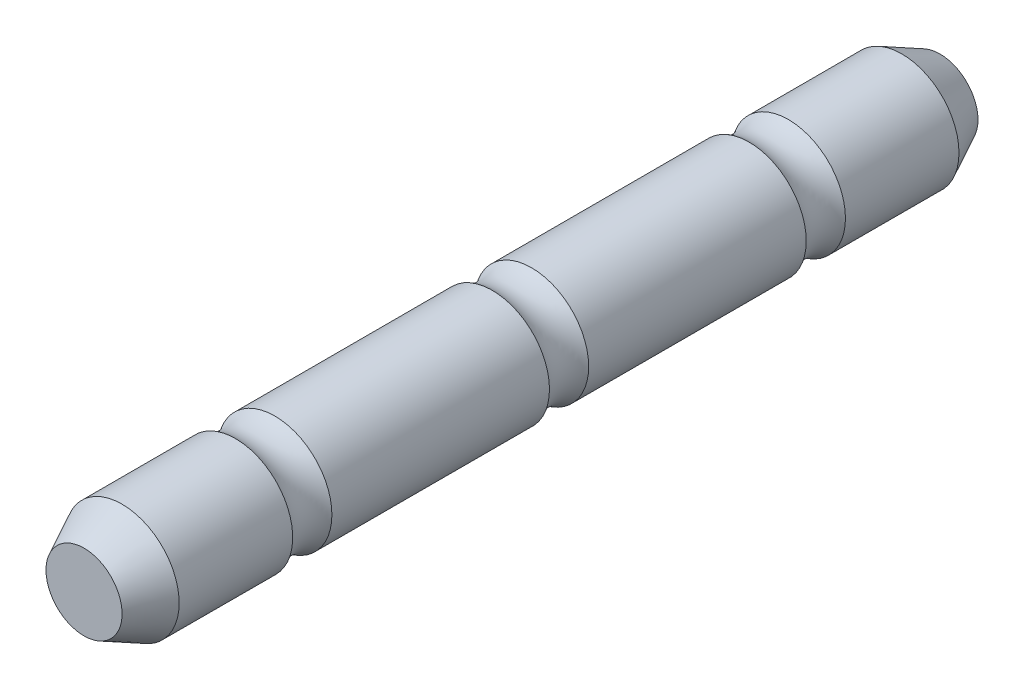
ISO-10303-21;
HEADER;
FILE_DESCRIPTION(('STEP AP214'),'2;1');
FILE_NAME('part.step','',(''),(''),'','','');
FILE_SCHEMA(('AUTOMOTIVE_DESIGN { 1 0 10303 214 1 1 1 1 }'));
ENDSEC;
DATA;
#1=APPLICATION_CONTEXT('core data for automotive mechanical design processes');
#2=APPLICATION_PROTOCOL_DEFINITION('international standard','automotive_design',2000,#1);
#3=PRODUCT_CONTEXT('',#1,'mechanical');
#4=PRODUCT('Part','Part','',(#3));
#5=PRODUCT_RELATED_PRODUCT_CATEGORY('part','',(#4));
#6=PRODUCT_DEFINITION_FORMATION('','',#4);
#7=PRODUCT_DEFINITION_CONTEXT('part definition',#1,'design');
#8=PRODUCT_DEFINITION('design','',#6,#7);
#9=PRODUCT_DEFINITION_SHAPE('','',#8);
#10=(LENGTH_UNIT() NAMED_UNIT(*) SI_UNIT(.MILLI.,.METRE.));
#11=(NAMED_UNIT(*) PLANE_ANGLE_UNIT() SI_UNIT($,.RADIAN.));
#12=(NAMED_UNIT(*) SI_UNIT($,.STERADIAN.) SOLID_ANGLE_UNIT());
#13=UNCERTAINTY_MEASURE_WITH_UNIT(LENGTH_MEASURE(1.E-05),#10,'distance_accuracy_value','');
#14=(GEOMETRIC_REPRESENTATION_CONTEXT(3) GLOBAL_UNCERTAINTY_ASSIGNED_CONTEXT((#13)) GLOBAL_UNIT_ASSIGNED_CONTEXT((#10,
#11,#12)) REPRESENTATION_CONTEXT('',''));
#15=CARTESIAN_POINT('',(0.,0.,0.));
#16=DIRECTION('',(0.,0.,1.));
#17=DIRECTION('',(1.,0.,0.));
#18=AXIS2_PLACEMENT_3D('',#15,#16,#17);
#19=CARTESIAN_POINT('',(0.,0.,-22.5));
#20=DIRECTION('',(0.,0.,-1.));
#21=DIRECTION('',(-1.,0.,0.));
#22=AXIS2_PLACEMENT_3D('',#19,#20,#21);
#23=PLANE('',#22);
#24=CARTESIAN_POINT('',(0.,0.,-22.5000000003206));
#25=DIRECTION('',(0.,0.,1.));
#26=DIRECTION('',(1.,0.,0.));
#27=AXIS2_PLACEMENT_3D('',#24,#25,#26);
#28=CIRCLE('',#27,2.00000000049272);
#29=CARTESIAN_POINT('',(2.00000000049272,0.,-22.5000000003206));
#30=VERTEX_POINT('',#29);
#31=EDGE_CURVE('E16',#30,#30,#28,.T.);
#32=ORIENTED_EDGE('',*,*,#31,.F.);
#33=EDGE_LOOP('',(#32));
#34=FACE_BOUND('',#33,.T.);
#35=ADVANCED_FACE('F13',(#34),#23,.T.);
#36=CARTESIAN_POINT('',(0.,0.,-20.4999999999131));
#37=DIRECTION('',(0.,0.,1.));
#38=DIRECTION('',(1.,0.,0.));
#39=AXIS2_PLACEMENT_3D('',#36,#37,#38);
#40=CONICAL_SURFACE('',#39,2.99999999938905,0.463647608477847);
#41=CARTESIAN_POINT('',(0.,0.,-20.5));
#42=DIRECTION('',(0.,0.,1.));
#43=DIRECTION('',(1.,0.,0.));
#44=AXIS2_PLACEMENT_3D('',#41,#42,#43);
#45=CIRCLE('',#44,3.);
#46=CARTESIAN_POINT('',(3.,0.,-20.5));
#47=VERTEX_POINT('',#46);
#48=EDGE_CURVE('E166',#47,#47,#45,.T.);
#49=ORIENTED_EDGE('',*,*,#48,.F.);
#50=EDGE_LOOP('',(#49));
#51=FACE_BOUND('',#50,.T.);
#52=ORIENTED_EDGE('',*,*,#31,.T.);
#53=EDGE_LOOP('',(#52));
#54=FACE_BOUND('',#53,.T.);
#55=ADVANCED_FACE('F93',(#51,#54),#40,.T.);
#56=CARTESIAN_POINT('',(0.,0.,22.5));
#57=DIRECTION('',(0.,0.,-1.));
#58=DIRECTION('',(-1.,0.,0.));
#59=AXIS2_PLACEMENT_3D('',#56,#57,#58);
#60=PLANE('',#59);
#61=CARTESIAN_POINT('',(0.,0.,22.5000000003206));
#62=DIRECTION('',(0.,0.,-1.));
#63=DIRECTION('',(-1.,0.,0.));
#64=AXIS2_PLACEMENT_3D('',#61,#62,#63);
#65=CIRCLE('',#64,2.00000000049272);
#66=CARTESIAN_POINT('',(-2.00000000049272,0.,22.5000000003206));
#67=VERTEX_POINT('',#66);
#68=EDGE_CURVE('E165',#67,#67,#65,.T.);
#69=ORIENTED_EDGE('',*,*,#68,.F.);
#70=EDGE_LOOP('',(#69));
#71=FACE_BOUND('',#70,.T.);
#72=ADVANCED_FACE('F90',(#71),#60,.F.);
#73=CARTESIAN_POINT('',(0.,0.,0.));
#74=DIRECTION('',(0.,0.,1.));
#75=DIRECTION('',(1.,0.,0.));
#76=AXIS2_PLACEMENT_3D('',#73,#74,#75);
#77=CYLINDRICAL_SURFACE('',#76,3.);
#78=CARTESIAN_POINT('',(0.,0.,-14.530727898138));
#79=DIRECTION('',(0.,0.,-1.));
#80=DIRECTION('',(-1.,0.,0.));
#81=AXIS2_PLACEMENT_3D('',#78,#79,#80);
#82=CIRCLE('',#81,3.);
#83=CARTESIAN_POINT('',(-3.,0.,-14.530727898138));
#84=VERTEX_POINT('',#83);
#85=EDGE_CURVE('E71',#84,#84,#82,.T.);
#86=ORIENTED_EDGE('',*,*,#85,.T.);
#87=EDGE_LOOP('',(#86));
#88=FACE_BOUND('',#87,.T.);
#89=ORIENTED_EDGE('',*,*,#48,.T.);
#90=EDGE_LOOP('',(#89));
#91=FACE_BOUND('',#90,.T.);
#92=ADVANCED_FACE('F86',(#88,#91),#77,.T.);
#93=CARTESIAN_POINT('',(0.,0.,20.4999999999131));
#94=DIRECTION('',(0.,0.,-1.));
#95=DIRECTION('',(-1.,0.,0.));
#96=AXIS2_PLACEMENT_3D('',#93,#94,#95);
#97=CONICAL_SURFACE('',#96,2.99999999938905,0.463647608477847);
#98=CARTESIAN_POINT('',(0.,0.,20.5));
#99=DIRECTION('',(0.,0.,1.));
#100=DIRECTION('',(1.,0.,0.));
#101=AXIS2_PLACEMENT_3D('',#98,#99,#100);
#102=CIRCLE('',#101,3.);
#103=CARTESIAN_POINT('',(3.,0.,20.5));
#104=VERTEX_POINT('',#103);
#105=EDGE_CURVE('E66',#104,#104,#102,.F.);
#106=ORIENTED_EDGE('',*,*,#105,.F.);
#107=EDGE_LOOP('',(#106));
#108=FACE_BOUND('',#107,.T.);
#109=ORIENTED_EDGE('',*,*,#68,.T.);
#110=EDGE_LOOP('',(#109));
#111=FACE_BOUND('',#110,.T.);
#112=ADVANCED_FACE('F82',(#108,#111),#97,.T.);
#113=CARTESIAN_POINT('',(0.,0.,-13.5));
#114=DIRECTION('',(0.,0.,-1.));
#115=DIRECTION('',(-1.,0.,0.));
#116=AXIS2_PLACEMENT_3D('',#113,#114,#115);
#117=TOROIDAL_SURFACE('',#116,4.5,1.82);
#118=CARTESIAN_POINT('',(0.,0.,-12.469272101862));
#119=DIRECTION('',(0.,0.,1.));
#120=DIRECTION('',(1.,0.,0.));
#121=AXIS2_PLACEMENT_3D('',#118,#119,#120);
#122=CIRCLE('',#121,3.);
#123=CARTESIAN_POINT('',(3.,0.,-12.469272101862));
#124=VERTEX_POINT('',#123);
#125=EDGE_CURVE('E60',#124,#124,#122,.T.);
#126=ORIENTED_EDGE('',*,*,#125,.F.);
#127=EDGE_LOOP('',(#126));
#128=FACE_BOUND('',#127,.T.);
#129=ORIENTED_EDGE('',*,*,#85,.F.);
#130=EDGE_LOOP('',(#129));
#131=FACE_BOUND('',#130,.T.);
#132=ADVANCED_FACE('F78',(#128,#131),#117,.F.);
#133=CARTESIAN_POINT('',(0.,0.,0.));
#134=DIRECTION('',(0.,0.,1.));
#135=DIRECTION('',(1.,0.,0.));
#136=AXIS2_PLACEMENT_3D('',#133,#134,#135);
#137=CYLINDRICAL_SURFACE('',#136,3.);
#138=ORIENTED_EDGE('',*,*,#105,.T.);
#139=EDGE_LOOP('',(#138));
#140=FACE_BOUND('',#139,.T.);
#141=CARTESIAN_POINT('',(0.,0.,14.530727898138));
#142=DIRECTION('',(0.,0.,-1.));
#143=DIRECTION('',(-1.,0.,0.));
#144=AXIS2_PLACEMENT_3D('',#141,#142,#143);
#145=CIRCLE('',#144,3.);
#146=CARTESIAN_POINT('',(-3.,0.,14.530727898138));
#147=VERTEX_POINT('',#146);
#148=EDGE_CURVE('E56',#147,#147,#145,.F.);
#149=ORIENTED_EDGE('',*,*,#148,.T.);
#150=EDGE_LOOP('',(#149));
#151=FACE_BOUND('',#150,.T.);
#152=ADVANCED_FACE('F81',(#140,#151),#137,.T.);
#153=CARTESIAN_POINT('',(0.,0.,0.));
#154=DIRECTION('',(0.,0.,1.));
#155=DIRECTION('',(1.,0.,0.));
#156=AXIS2_PLACEMENT_3D('',#153,#154,#155);
#157=CYLINDRICAL_SURFACE('',#156,3.);
#158=ORIENTED_EDGE('',*,*,#125,.T.);
#159=EDGE_LOOP('',(#158));
#160=FACE_BOUND('',#159,.T.);
#161=CARTESIAN_POINT('',(0.,0.,-1.03072789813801));
#162=DIRECTION('',(0.,0.,-1.));
#163=DIRECTION('',(-1.,0.,0.));
#164=AXIS2_PLACEMENT_3D('',#161,#162,#163);
#165=CIRCLE('',#164,3.);
#166=CARTESIAN_POINT('',(-3.,0.,-1.03072789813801));
#167=VERTEX_POINT('',#166);
#168=EDGE_CURVE('E29',#167,#167,#165,.T.);
#169=ORIENTED_EDGE('',*,*,#168,.T.);
#170=EDGE_LOOP('',(#169));
#171=FACE_BOUND('',#170,.T.);
#172=ADVANCED_FACE('F50',(#160,#171),#157,.T.);
#173=CARTESIAN_POINT('',(0.,0.,13.5));
#174=DIRECTION('',(0.,0.,-1.));
#175=DIRECTION('',(-1.,0.,0.));
#176=AXIS2_PLACEMENT_3D('',#173,#174,#175);
#177=TOROIDAL_SURFACE('',#176,4.5,1.82);
#178=ORIENTED_EDGE('',*,*,#148,.F.);
#179=EDGE_LOOP('',(#178));
#180=FACE_BOUND('',#179,.T.);
#181=CARTESIAN_POINT('',(0.,0.,12.469272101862));
#182=DIRECTION('',(0.,0.,1.));
#183=DIRECTION('',(1.,0.,0.));
#184=AXIS2_PLACEMENT_3D('',#181,#182,#183);
#185=CIRCLE('',#184,3.);
#186=CARTESIAN_POINT('',(3.,0.,12.469272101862));
#187=VERTEX_POINT('',#186);
#188=EDGE_CURVE('E21',#187,#187,#185,.F.);
#189=ORIENTED_EDGE('',*,*,#188,.F.);
#190=EDGE_LOOP('',(#189));
#191=FACE_BOUND('',#190,.T.);
#192=ADVANCED_FACE('F45',(#180,#191),#177,.F.);
#193=CARTESIAN_POINT('',(0.,0.,0.));
#194=DIRECTION('',(0.,0.,-1.));
#195=DIRECTION('',(-1.,0.,0.));
#196=AXIS2_PLACEMENT_3D('',#193,#194,#195);
#197=TOROIDAL_SURFACE('',#196,4.5,1.82);
#198=CARTESIAN_POINT('',(0.,0.,1.03072789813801));
#199=DIRECTION('',(0.,0.,1.));
#200=DIRECTION('',(1.,0.,0.));
#201=AXIS2_PLACEMENT_3D('',#198,#199,#200);
#202=CIRCLE('',#201,3.);
#203=CARTESIAN_POINT('',(3.,0.,1.03072789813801));
#204=VERTEX_POINT('',#203);
#205=EDGE_CURVE('E9',#204,#204,#202,.T.);
#206=ORIENTED_EDGE('',*,*,#205,.F.);
#207=EDGE_LOOP('',(#206));
#208=FACE_BOUND('',#207,.T.);
#209=ORIENTED_EDGE('',*,*,#168,.F.);
#210=EDGE_LOOP('',(#209));
#211=FACE_BOUND('',#210,.T.);
#212=ADVANCED_FACE('F40',(#208,#211),#197,.F.);
#213=CARTESIAN_POINT('',(0.,0.,0.));
#214=DIRECTION('',(0.,0.,1.));
#215=DIRECTION('',(1.,0.,0.));
#216=AXIS2_PLACEMENT_3D('',#213,#214,#215);
#217=CYLINDRICAL_SURFACE('',#216,3.);
#218=ORIENTED_EDGE('',*,*,#205,.T.);
#219=EDGE_LOOP('',(#218));
#220=FACE_BOUND('',#219,.T.);
#221=ORIENTED_EDGE('',*,*,#188,.T.);
#222=EDGE_LOOP('',(#221));
#223=FACE_BOUND('',#222,.T.);
#224=ADVANCED_FACE('F44',(#220,#223),#217,.T.);
#225=CLOSED_SHELL('',(#35,#55,#72,#92,#112,#132,#152,#172,#192,#212,#224));
#226=MANIFOLD_SOLID_BREP('B1',#225);
#227=ADVANCED_BREP_SHAPE_REPRESENTATION('',(#18,#226),#14);
#228=SHAPE_DEFINITION_REPRESENTATION(#9,#227);
ENDSEC;
END-ISO-10303-21;
